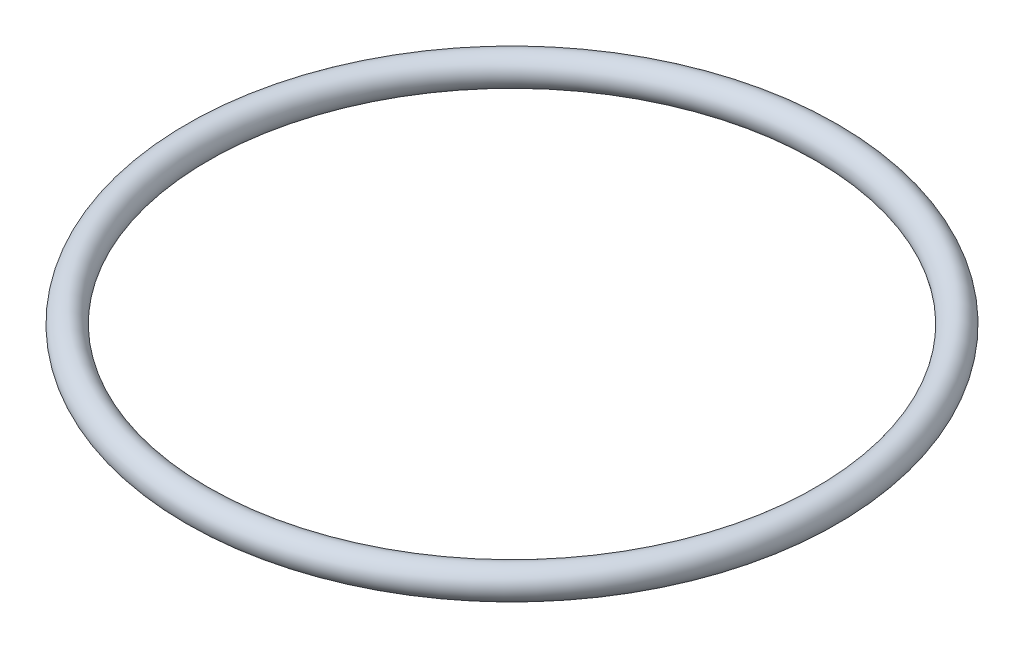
from build123d import *

# Parameters (mm, degrees)
ESQUISSE1_R = 1.25


with BuildPart() as part:
    # Esquisse1 → Base-R_volution (revolve)
    with BuildSketch(Plane.XY, mode=Mode.PRIVATE) as base_r_volution_sk:
        with Locations((26.25, 0)):
            Circle(ESQUISSE1_R)
    revolve(base_r_volution_sk.sketch.rotate(Axis((0, 1.25, 0), (0, -1, 0)), 90), axis=Axis((0, 1.25, 0), (0, -1, 0)))


solid = part.part
